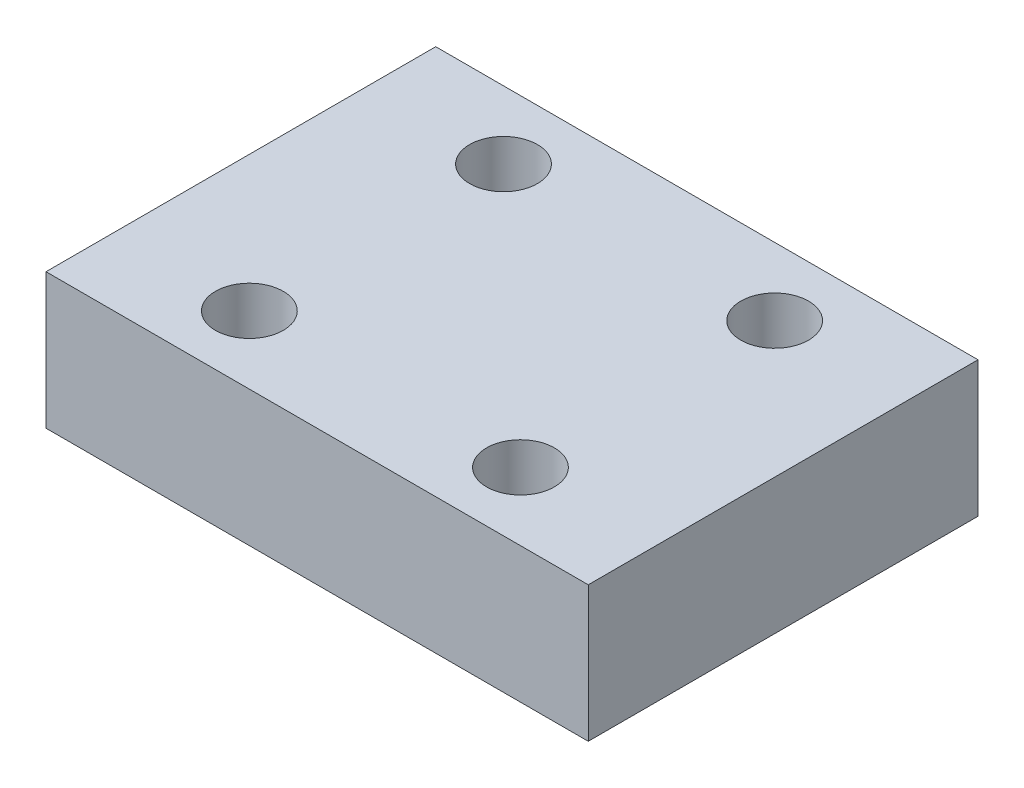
from build123d import *

# Parameters (mm, degrees)
SKETCH_1_W      = 32
SKETCH_1_H      = 23
SKETCH_1_R      = 2
EXTRUDE_1_DEPTH = 8


with BuildPart() as part:
    # Sketch 1 → Extrude 1 (new body)
    with BuildSketch(Plane(origin=(0, 0, 0), x_dir=(1, 0, 0), z_dir=(0, 1, 0))):
        with Locations((-2.512195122, -4.113821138)):
            Rectangle(SKETCH_1_W, SKETCH_1_H)
        with Locations(Location((-10.512195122, 3.386178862, 0), (0, 0, 270))):
            Circle(SKETCH_1_R, mode=Mode.SUBTRACT)
        with Locations(Location((5.487804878, 3.386178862, 0), (0, 0, 270))):
            Circle(SKETCH_1_R, mode=Mode.SUBTRACT)
        with Locations(Location((-10.512195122, -11.613821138, 0), (0, 0, 270))):
            Circle(SKETCH_1_R, mode=Mode.SUBTRACT)
        with Locations(Location((5.487804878, -11.613821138, 0), (0, 0, 270))):
            Circle(SKETCH_1_R, mode=Mode.SUBTRACT)
    extrude(amount=EXTRUDE_1_DEPTH)


solid = part.part
